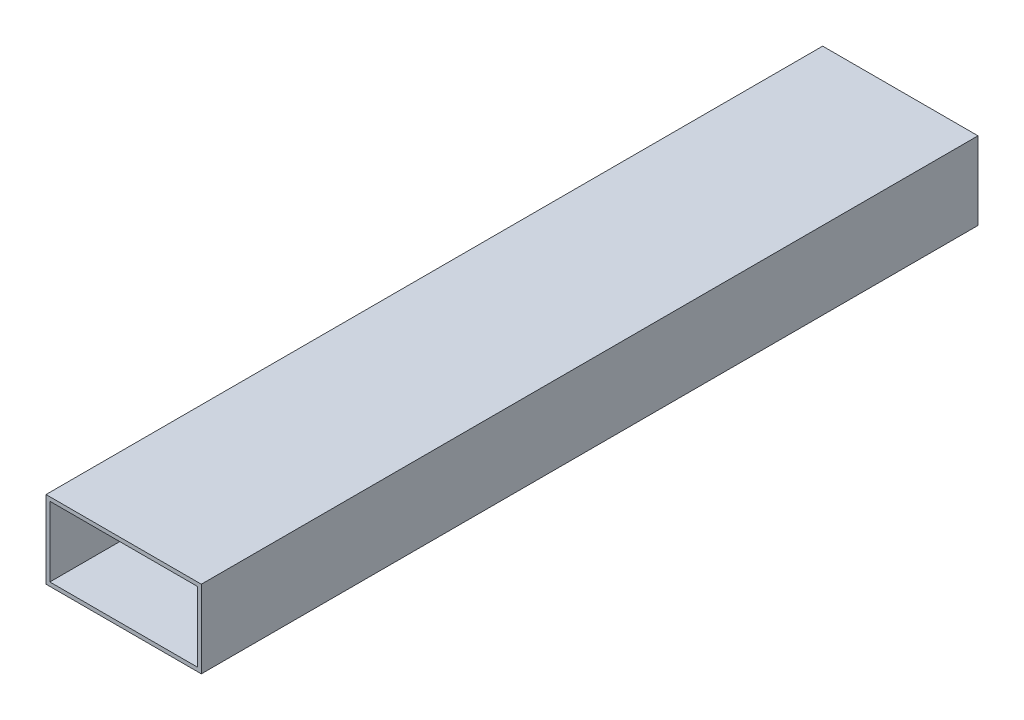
from build123d import *

# Parameters (mm, degrees)
ESQUISSE1_W        = 80
ESQUISSE1_H        = 40
ESQUISSE1_W_2      = 76
ESQUISSE1_H_2      = 36
BOSS_EXTRU_1_DEPTH = 400


with BuildPart() as part:
    # Esquisse1 → Boss.-Extru.1 (new body)
    with BuildSketch(Plane.XY):
        Rectangle(ESQUISSE1_W, ESQUISSE1_H)
        Rectangle(ESQUISSE1_W_2, ESQUISSE1_H_2, mode=Mode.SUBTRACT)
    extrude(amount=BOSS_EXTRU_1_DEPTH)


solid = part.part
